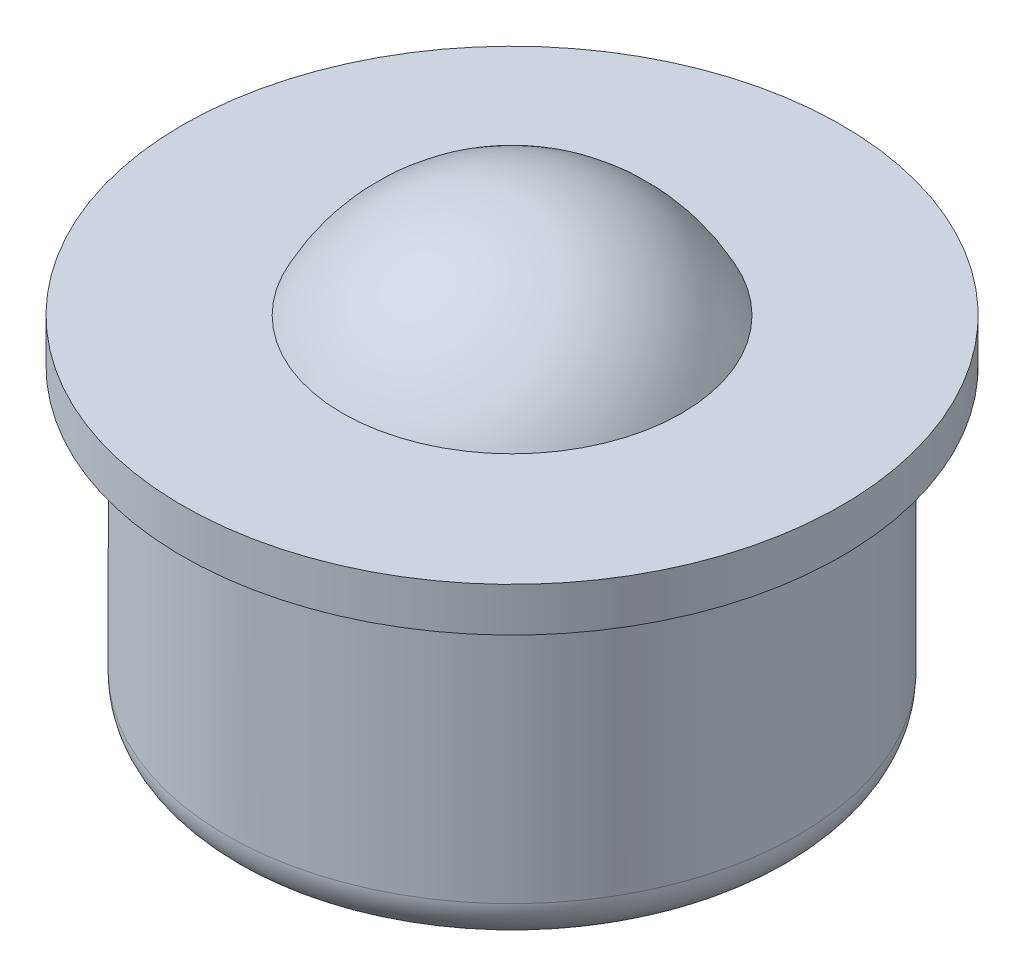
ISO-10303-21;
HEADER;
FILE_DESCRIPTION(('STEP AP214'),'2;1');
FILE_NAME('part.step','',(''),(''),'','','');
FILE_SCHEMA(('AUTOMOTIVE_DESIGN { 1 0 10303 214 1 1 1 1 }'));
ENDSEC;
DATA;
#1=APPLICATION_CONTEXT('core data for automotive mechanical design processes');
#2=APPLICATION_PROTOCOL_DEFINITION('international standard','automotive_design',2000,#1);
#3=PRODUCT_CONTEXT('',#1,'mechanical');
#4=PRODUCT('Part','Part','',(#3));
#5=PRODUCT_RELATED_PRODUCT_CATEGORY('part','',(#4));
#6=PRODUCT_DEFINITION_FORMATION('','',#4);
#7=PRODUCT_DEFINITION_CONTEXT('part definition',#1,'design');
#8=PRODUCT_DEFINITION('design','',#6,#7);
#9=PRODUCT_DEFINITION_SHAPE('','',#8);
#10=(LENGTH_UNIT() NAMED_UNIT(*) SI_UNIT(.MILLI.,.METRE.));
#11=(NAMED_UNIT(*) PLANE_ANGLE_UNIT() SI_UNIT($,.RADIAN.));
#12=(NAMED_UNIT(*) SI_UNIT($,.STERADIAN.) SOLID_ANGLE_UNIT());
#13=UNCERTAINTY_MEASURE_WITH_UNIT(LENGTH_MEASURE(1.E-05),#10,'distance_accuracy_value','');
#14=(GEOMETRIC_REPRESENTATION_CONTEXT(3) GLOBAL_UNCERTAINTY_ASSIGNED_CONTEXT((#13)) GLOBAL_UNIT_ASSIGNED_CONTEXT((#10,
#11,#12)) REPRESENTATION_CONTEXT('',''));
#15=CARTESIAN_POINT('',(0.,0.,0.));
#16=DIRECTION('',(0.,0.,1.));
#17=DIRECTION('',(1.,0.,0.));
#18=AXIS2_PLACEMENT_3D('',#15,#16,#17);
#19=CARTESIAN_POINT('',(0.,-5.99999999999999,0.));
#20=DIRECTION('',(0.,-1.,0.));
#21=DIRECTION('',(1.,0.,0.));
#22=AXIS2_PLACEMENT_3D('',#19,#20,#21);
#23=TOROIDAL_SURFACE('',#22,5.50000000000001,1.);
#24=CARTESIAN_POINT('',(0.,-6.99999999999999,0.));
#25=DIRECTION('',(0.,-1.,0.));
#26=DIRECTION('',(1.,0.,0.));
#27=AXIS2_PLACEMENT_3D('',#24,#25,#26);
#28=CIRCLE('',#27,5.50000000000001);
#29=CARTESIAN_POINT('',(5.50000000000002,-6.99999999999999,0.));
#30=VERTEX_POINT('',#29);
#31=EDGE_CURVE('E40',#30,#30,#28,.T.);
#32=ORIENTED_EDGE('',*,*,#31,.F.);
#33=EDGE_LOOP('',(#32));
#34=FACE_BOUND('',#33,.T.);
#35=CARTESIAN_POINT('',(0.,-5.99999999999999,0.));
#36=DIRECTION('',(0.,-1.,0.));
#37=DIRECTION('',(1.,0.,0.));
#38=AXIS2_PLACEMENT_3D('',#35,#36,#37);
#39=CIRCLE('',#38,6.50000000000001);
#40=CARTESIAN_POINT('',(6.50000000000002,-5.99999999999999,0.));
#41=VERTEX_POINT('',#40);
#42=EDGE_CURVE('E10',#41,#41,#39,.T.);
#43=ORIENTED_EDGE('',*,*,#42,.T.);
#44=EDGE_LOOP('',(#43));
#45=FACE_BOUND('',#44,.T.);
#46=ADVANCED_FACE('F33',(#34,#45),#23,.T.);
#47=CARTESIAN_POINT('',(0.,-7.,0.));
#48=DIRECTION('',(0.,-1.,0.));
#49=DIRECTION('',(1.,0.,0.));
#50=AXIS2_PLACEMENT_3D('',#47,#48,#49);
#51=CYLINDRICAL_SURFACE('',#50,6.50000000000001);
#52=ORIENTED_EDGE('',*,*,#42,.F.);
#53=EDGE_LOOP('',(#52));
#54=FACE_BOUND('',#53,.T.);
#55=CARTESIAN_POINT('',(0.,0.,0.));
#56=DIRECTION('',(0.,1.,0.));
#57=DIRECTION('',(-1.,0.,0.));
#58=AXIS2_PLACEMENT_3D('',#55,#56,#57);
#59=CIRCLE('',#58,6.50000000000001);
#60=CARTESIAN_POINT('',(-6.50000000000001,0.,0.));
#61=VERTEX_POINT('',#60);
#62=EDGE_CURVE('E44',#61,#61,#59,.T.);
#63=ORIENTED_EDGE('',*,*,#62,.F.);
#64=EDGE_LOOP('',(#63));
#65=FACE_BOUND('',#64,.T.);
#66=ADVANCED_FACE('F79',(#54,#65),#51,.T.);
#67=CARTESIAN_POINT('',(-5.5,-7.,0.));
#68=DIRECTION('',(0.,1.,0.));
#69=DIRECTION('',(-1.,0.,0.));
#70=AXIS2_PLACEMENT_3D('',#67,#68,#69);
#71=PLANE('',#70);
#72=ORIENTED_EDGE('',*,*,#31,.T.);
#73=EDGE_LOOP('',(#72));
#74=FACE_BOUND('',#73,.T.);
#75=ADVANCED_FACE('F61',(#74),#71,.F.);
#76=CARTESIAN_POINT('',(0.,1.,0.));
#77=DIRECTION('',(0.,-1.,0.));
#78=DIRECTION('',(1.,0.,0.));
#79=AXIS2_PLACEMENT_3D('',#76,#77,#78);
#80=CYLINDRICAL_SURFACE('',#79,7.5);
#81=CARTESIAN_POINT('',(0.,1.,0.));
#82=DIRECTION('',(0.,1.,0.));
#83=DIRECTION('',(-1.,0.,0.));
#84=AXIS2_PLACEMENT_3D('',#81,#82,#83);
#85=CIRCLE('',#84,7.5);
#86=CARTESIAN_POINT('',(-7.5,0.999999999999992,0.));
#87=VERTEX_POINT('',#86);
#88=EDGE_CURVE('E49',#87,#87,#85,.T.);
#89=ORIENTED_EDGE('',*,*,#88,.F.);
#90=EDGE_LOOP('',(#89));
#91=FACE_BOUND('',#90,.T.);
#92=CARTESIAN_POINT('',(0.,0.,0.));
#93=DIRECTION('',(0.,1.,0.));
#94=DIRECTION('',(-1.,0.,0.));
#95=AXIS2_PLACEMENT_3D('',#92,#93,#94);
#96=CIRCLE('',#95,7.5);
#97=CARTESIAN_POINT('',(-7.5,0.,0.));
#98=VERTEX_POINT('',#97);
#99=EDGE_CURVE('E50',#98,#98,#96,.T.);
#100=ORIENTED_EDGE('',*,*,#99,.T.);
#101=EDGE_LOOP('',(#100));
#102=FACE_BOUND('',#101,.T.);
#103=ADVANCED_FACE('F58',(#91,#102),#80,.T.);
#104=CARTESIAN_POINT('',(0.,1.,0.));
#105=DIRECTION('',(0.,1.,0.));
#106=DIRECTION('',(-1.,0.,0.));
#107=AXIS2_PLACEMENT_3D('',#104,#105,#106);
#108=PLANE('',#107);
#109=CARTESIAN_POINT('',(0.,1.,0.));
#110=DIRECTION('',(0.,1.,0.));
#111=DIRECTION('',(-1.,0.,0.));
#112=AXIS2_PLACEMENT_3D('',#109,#110,#111);
#113=CIRCLE('',#112,3.8609679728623);
#114=CARTESIAN_POINT('',(-3.8609679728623,0.999999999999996,0.));
#115=VERTEX_POINT('',#114);
#116=EDGE_CURVE('E36',#115,#115,#113,.F.);
#117=ORIENTED_EDGE('',*,*,#116,.T.);
#118=EDGE_LOOP('',(#117));
#119=FACE_BOUND('',#118,.T.);
#120=ORIENTED_EDGE('',*,*,#88,.T.);
#121=EDGE_LOOP('',(#120));
#122=FACE_BOUND('',#121,.T.);
#123=ADVANCED_FACE('F56',(#119,#122),#108,.T.);
#124=CARTESIAN_POINT('',(0.,0.,0.));
#125=DIRECTION('',(0.,1.,0.));
#126=DIRECTION('',(-1.,0.,0.));
#127=AXIS2_PLACEMENT_3D('',#124,#125,#126);
#128=PLANE('',#127);
#129=ORIENTED_EDGE('',*,*,#62,.T.);
#130=EDGE_LOOP('',(#129));
#131=FACE_BOUND('',#130,.T.);
#132=ORIENTED_EDGE('',*,*,#99,.F.);
#133=EDGE_LOOP('',(#132));
#134=FACE_BOUND('',#133,.T.);
#135=ADVANCED_FACE('F65',(#131,#134),#128,.F.);
#136=CARTESIAN_POINT('',(0.,-0.937866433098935,0.));
#137=DIRECTION('',(0.,1.,0.));
#138=DIRECTION('',(0.,0.,1.));
#139=AXIS2_PLACEMENT_3D('',#136,#137,#138);
#140=SPHERICAL_SURFACE('',#139,4.32);
#141=ORIENTED_EDGE('',*,*,#116,.F.);
#142=EDGE_LOOP('',(#141));
#143=FACE_BOUND('',#142,.T.);
#144=ADVANCED_FACE('F67',(#143),#140,.T.);
#145=CLOSED_SHELL('',(#46,#66,#75,#103,#123,#135,#144));
#146=MANIFOLD_SOLID_BREP('B2',#145);
#147=ADVANCED_BREP_SHAPE_REPRESENTATION('',(#18,#146),#14);
#148=SHAPE_DEFINITION_REPRESENTATION(#9,#147);
ENDSEC;
END-ISO-10303-21;
